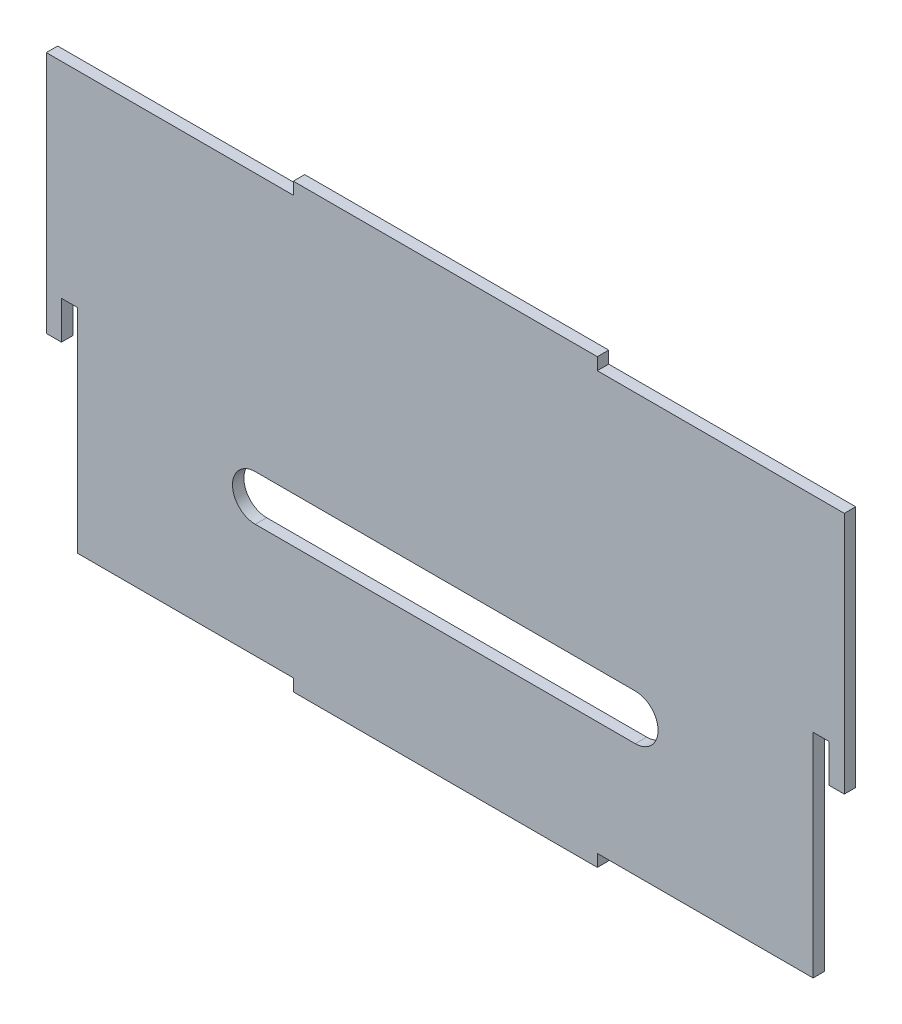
from build123d import *

# Parameters (mm, degrees)
BOSS_EXTRU_1_DEPTH      = 1.5
ENL_V_MAT_EXTRU_2_DEPTH = 10
ESQUISSE3_W             = 2
ESQUISSE3_H             = 23
ENL_V_MAT_EXTRU_3_DEPTH = 10


with BuildPart() as part:
    # Esquisse1 → Boss.-Extru.1 (new body)
    with BuildSketch(Plane.XY):
        Polygon((-52.5, 27.5), (-52.5, -27.5), (-50.5, -27.5), (-50.5, 0.5), (-48.4, 0.5), (-48.4, -27.5), (-20, -27.5), (-20, -29.1), (20, -29.1), (20, -27.5), (48.4, -27.5), (48.4, 0.5), (50.5, 0.5), (50.5, -27.5), (52.5, -27.5), (52.5, 27.5), (20, 27.5), (20, 29.1), (-20, 29.1), (-20, 27.5), align=None)
    extrude(amount=BOSS_EXTRU_1_DEPTH)

    # Esquisse2 → Enl_v. mat.-Extru.2 (cut)
    with BuildSketch(Plane.XY):
        with BuildLine():
            Line((-25, -6.5), (25, -6.5))
            ThreePointArc((25, -6.5), (28, -9.5), (25, -12.5))
            Line((25, -12.5), (-25, -12.5))
            ThreePointArc((-25, -12.5), (-28, -9.5), (-25, -6.5))
        make_face()
    extrude(amount=ENL_V_MAT_EXTRU_2_DEPTH, mode=Mode.SUBTRACT)

    # Esquisse3 → Enl_v. mat.-Extru.3 (cut)
    with BuildSketch(Plane.XY.offset(1.5)):
        with Locations((-51.5, -16)):
            Rectangle(ESQUISSE3_W, ESQUISSE3_H)
        with Locations((51.5, -16)):
            Rectangle(ESQUISSE3_W, ESQUISSE3_H)
    extrude(amount=-ENL_V_MAT_EXTRU_3_DEPTH, mode=Mode.SUBTRACT)


solid = part.part
